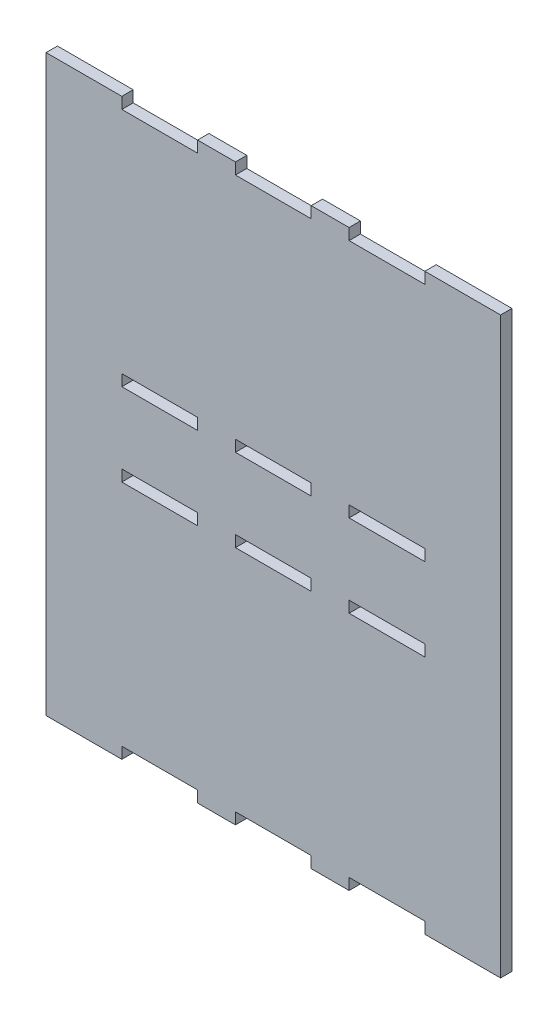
from build123d import *

# Parameters (mm, degrees)
ESQUISSE1_W        = 20
ESQUISSE1_H        = 3
BOSS_EXTRU_1_DEPTH = 3


with BuildPart() as part:
    # Esquisse1 → Boss.-Extru.1 (new body)
    with BuildSketch(Plane.XY):
        Polygon((10, 0), (0, 0), (-10, 0), (-10, 3), (-20, 3), (-20, 0), (-40, 0), (-40, 3), (-60, 3), (-60, -148.6), (-40, -148.6), (-40, -145.6), (-20, -145.6), (-20, -148.6), (-10, -148.6), (-10, -145.6), (0, -145.6), (10, -145.6), (10, -148.6), (20, -148.6), (20, -145.6), (40, -145.6), (40, -148.6), (60, -148.6), (60, 3), (40, 3), (40, 0), (20, 0), (20, 3), (10, 3), align=None)
        with Locations((-30, -83.7)):
            Rectangle(ESQUISSE1_W, ESQUISSE1_H, mode=Mode.SUBTRACT)
        with Locations((0, -83.7)):
            Rectangle(ESQUISSE1_W, ESQUISSE1_H, mode=Mode.SUBTRACT)
        with Locations((30, -83.7)):
            Rectangle(ESQUISSE1_W, ESQUISSE1_H, mode=Mode.SUBTRACT)
        with Locations((-30, -61.9)):
            Rectangle(ESQUISSE1_W, ESQUISSE1_H, mode=Mode.SUBTRACT)
        with Locations((0, -61.9)):
            Rectangle(ESQUISSE1_W, ESQUISSE1_H, mode=Mode.SUBTRACT)
        with Locations((30, -61.9)):
            Rectangle(ESQUISSE1_W, ESQUISSE1_H, mode=Mode.SUBTRACT)
    extrude(amount=BOSS_EXTRU_1_DEPTH)


solid = part.part
